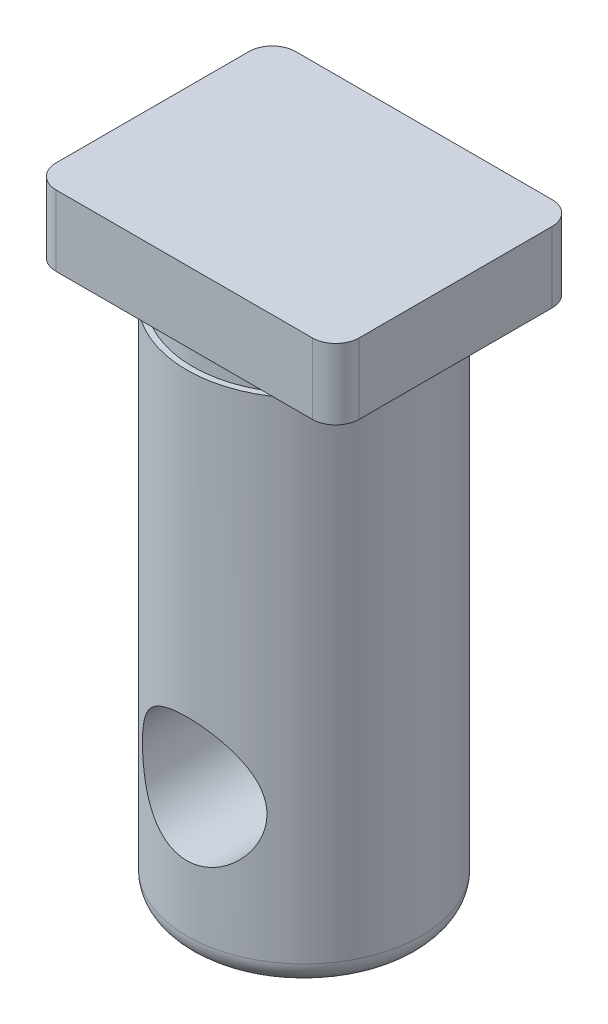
ISO-10303-21;
HEADER;
FILE_DESCRIPTION(('STEP AP214'),'2;1');
FILE_NAME('part.step','',(''),(''),'','','');
FILE_SCHEMA(('AUTOMOTIVE_DESIGN { 1 0 10303 214 1 1 1 1 }'));
ENDSEC;
DATA;
#1=APPLICATION_CONTEXT('core data for automotive mechanical design processes');
#2=APPLICATION_PROTOCOL_DEFINITION('international standard','automotive_design',2000,#1);
#3=PRODUCT_CONTEXT('',#1,'mechanical');
#4=PRODUCT('Part','Part','',(#3));
#5=PRODUCT_RELATED_PRODUCT_CATEGORY('part','',(#4));
#6=PRODUCT_DEFINITION_FORMATION('','',#4);
#7=PRODUCT_DEFINITION_CONTEXT('part definition',#1,'design');
#8=PRODUCT_DEFINITION('design','',#6,#7);
#9=PRODUCT_DEFINITION_SHAPE('','',#8);
#10=(LENGTH_UNIT() NAMED_UNIT(*) SI_UNIT(.MILLI.,.METRE.));
#11=(NAMED_UNIT(*) PLANE_ANGLE_UNIT() SI_UNIT($,.RADIAN.));
#12=(NAMED_UNIT(*) SI_UNIT($,.STERADIAN.) SOLID_ANGLE_UNIT());
#13=UNCERTAINTY_MEASURE_WITH_UNIT(LENGTH_MEASURE(1.E-05),#10,'distance_accuracy_value','');
#14=(GEOMETRIC_REPRESENTATION_CONTEXT(3) GLOBAL_UNCERTAINTY_ASSIGNED_CONTEXT((#13)) GLOBAL_UNIT_ASSIGNED_CONTEXT((#10,
#11,#12)) REPRESENTATION_CONTEXT('',''));
#15=CARTESIAN_POINT('',(0.,0.,0.));
#16=DIRECTION('',(0.,0.,1.));
#17=DIRECTION('',(1.,0.,0.));
#18=AXIS2_PLACEMENT_3D('',#15,#16,#17);
#19=CARTESIAN_POINT('',(0.,20.4216,0.));
#20=DIRECTION('',(0.,-1.,0.));
#21=DIRECTION('',(0.,0.,-1.));
#22=AXIS2_PLACEMENT_3D('',#19,#20,#21);
#23=CYLINDRICAL_SURFACE('',#22,3.94335);
#24=CARTESIAN_POINT('',(0.,0.787400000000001,0.));
#25=DIRECTION('',(0.,1.,0.));
#26=DIRECTION('',(0.,0.,1.));
#27=AXIS2_PLACEMENT_3D('',#24,#25,#26);
#28=CIRCLE('',#27,3.94335);
#29=CARTESIAN_POINT('',(0.,0.787400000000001,3.94335));
#30=VERTEX_POINT('',#29);
#31=EDGE_CURVE('E43',#30,#30,#28,.T.);
#32=ORIENTED_EDGE('',*,*,#31,.T.);
#33=EDGE_LOOP('',(#32));
#34=FACE_BOUND('',#33,.T.);
#35=CARTESIAN_POINT('',(0.,7.1755,-3.94335));
#36=CARTESIAN_POINT('',(-0.109314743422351,7.175491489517,-3.9433426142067));
#37=CARTESIAN_POINT('',(-0.218739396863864,7.16689548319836,-3.93875669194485));
#38=CARTESIAN_POINT('',(-0.434298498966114,7.13291400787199,-3.92086025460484));
#39=CARTESIAN_POINT('',(-0.540427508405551,7.1075021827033,-3.90753604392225));
#40=CARTESIAN_POINT('',(-0.745963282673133,7.04119182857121,-3.87354587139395));
#41=CARTESIAN_POINT('',(-0.845395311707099,7.00035584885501,-3.85290958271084));
#42=CARTESIAN_POINT('',(-1.03581840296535,6.90470969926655,-3.80614204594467));
#43=CARTESIAN_POINT('',(-1.12680946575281,6.84989953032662,-3.78001079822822));
#44=CARTESIAN_POINT('',(-1.30449764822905,6.7237898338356,-3.7225766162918));
#45=CARTESIAN_POINT('',(-1.39051867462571,6.65164284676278,-3.69104656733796));
#46=CARTESIAN_POINT('',(-1.54987441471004,6.49475456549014,-3.62702185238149));
#47=CARTESIAN_POINT('',(-1.62319810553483,6.41000244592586,-3.5945263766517));
#48=CARTESIAN_POINT('',(-1.76175498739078,6.22116637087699,-3.52882768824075));
#49=CARTESIAN_POINT('',(-1.82565800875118,6.11602750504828,-3.49582595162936));
#50=CARTESIAN_POINT('',(-1.93461489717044,5.89460177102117,-3.43673378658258));
#51=CARTESIAN_POINT('',(-1.97968328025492,5.77832357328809,-3.41063804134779));
#52=CARTESIAN_POINT('',(-2.04657178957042,5.54521156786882,-3.37090384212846));
#53=CARTESIAN_POINT('',(-2.06966732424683,5.42886536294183,-3.35658955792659));
#54=CARTESIAN_POINT('',(-2.09578899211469,5.19314629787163,-3.34035082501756));
#55=CARTESIAN_POINT('',(-2.09884011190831,5.0737773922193,-3.33841095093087));
#56=CARTESIAN_POINT('',(-2.08571706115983,4.85335793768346,-3.34661189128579));
#57=CARTESIAN_POINT('',(-2.07216395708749,4.75207371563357,-3.35510613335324));
#58=CARTESIAN_POINT('',(-2.03081783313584,4.55351336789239,-3.38029120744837));
#59=CARTESIAN_POINT('',(-2.00301916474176,4.45623884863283,-3.39698529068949));
#60=CARTESIAN_POINT('',(-1.93353957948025,4.26570974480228,-3.43701370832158));
#61=CARTESIAN_POINT('',(-1.89155978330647,4.17259525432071,-3.46048927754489));
#62=CARTESIAN_POINT('',(-1.79515444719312,3.9942617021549,-3.51146705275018));
#63=CARTESIAN_POINT('',(-1.74072338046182,3.90904617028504,-3.53897104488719));
#64=CARTESIAN_POINT('',(-1.61173736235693,3.73585893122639,-3.59973576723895));
#65=CARTESIAN_POINT('',(-1.53540579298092,3.64929494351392,-3.63325135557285));
#66=CARTESIAN_POINT('',(-1.36928012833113,3.48956608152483,-3.69906319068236));
#67=CARTESIAN_POINT('',(-1.27947798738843,3.41640927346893,-3.73135869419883));
#68=CARTESIAN_POINT('',(-1.08235198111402,3.28146925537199,-3.79338907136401));
#69=CARTESIAN_POINT('',(-0.97430883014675,3.22060629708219,-3.8228621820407));
#70=CARTESIAN_POINT('',(-0.747564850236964,3.11844721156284,-3.8735777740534));
#71=CARTESIAN_POINT('',(-0.628873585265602,3.07713373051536,-3.89482755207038));
#72=CARTESIAN_POINT('',(-0.395572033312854,3.01898654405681,-3.92506170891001));
#73=CARTESIAN_POINT('',(-0.281547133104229,3.00029294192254,-3.93497356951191));
#74=CARTESIAN_POINT('',(-0.0515707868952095,2.98196682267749,-3.94468818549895));
#75=CARTESIAN_POINT('',(0.0643795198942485,2.98232340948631,-3.9444967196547));
#76=CARTESIAN_POINT('',(0.283787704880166,3.00115119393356,-3.93452083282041));
#77=CARTESIAN_POINT('',(0.38743144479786,3.01799079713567,-3.92560047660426));
#78=CARTESIAN_POINT('',(0.590175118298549,3.06662377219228,-3.90027470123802));
#79=CARTESIAN_POINT('',(0.689274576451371,3.09841870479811,-3.88386850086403));
#80=CARTESIAN_POINT('',(0.883063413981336,3.17670789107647,-3.8445075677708));
#81=CARTESIAN_POINT('',(0.977578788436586,3.22355229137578,-3.82139826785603));
#82=CARTESIAN_POINT('',(1.15768289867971,3.33018391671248,-3.77074862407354));
#83=CARTESIAN_POINT('',(1.24326810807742,3.38997622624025,-3.74320654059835));
#84=CARTESIAN_POINT('',(1.41283744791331,3.52815577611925,-3.68277644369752));
#85=CARTESIAN_POINT('',(1.49566721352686,3.60784903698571,-3.6496318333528));
#86=CARTESIAN_POINT('',(1.64736854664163,3.77982211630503,-3.58371892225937));
#87=CARTESIAN_POINT('',(1.71622737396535,3.87211329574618,-3.55095099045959));
#88=CARTESIAN_POINT('',(1.84244439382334,4.07420348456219,-3.48722441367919));
#89=CARTESIAN_POINT('',(1.89874042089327,4.18475680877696,-3.45652886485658));
#90=CARTESIAN_POINT('',(1.99135240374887,4.41586544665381,-3.40402611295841));
#91=CARTESIAN_POINT('',(2.02769669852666,4.53640629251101,-3.38220631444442));
#92=CARTESIAN_POINT('',(2.07579703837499,4.7715527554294,-3.35287957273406));
#93=CARTESIAN_POINT('',(2.08961304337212,4.88558299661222,-3.3441798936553));
#94=CARTESIAN_POINT('',(2.09833946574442,5.11462084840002,-3.33871548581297));
#95=CARTESIAN_POINT('',(2.09326243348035,5.22962775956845,-3.34194283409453));
#96=CARTESIAN_POINT('',(2.06632746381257,5.44269314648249,-3.35864382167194));
#97=CARTESIAN_POINT('',(2.04655507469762,5.54113008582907,-3.37084220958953));
#98=CARTESIAN_POINT('',(1.99361124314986,5.73311276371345,-3.40242088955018));
#99=CARTESIAN_POINT('',(1.96043488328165,5.82665669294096,-3.42180381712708));
#100=CARTESIAN_POINT('',(1.87927782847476,6.01296489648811,-3.46707491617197));
#101=CARTESIAN_POINT('',(1.83047811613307,6.10528707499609,-3.493302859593));
#102=CARTESIAN_POINT('',(1.72028224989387,6.28105113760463,-3.54886567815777));
#103=CARTESIAN_POINT('',(1.65887931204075,6.36448820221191,-3.57820222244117));
#104=CARTESIAN_POINT('',(1.51494097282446,6.53258360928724,-3.6417013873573));
#105=CARTESIAN_POINT('',(1.43063833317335,6.6157044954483,-3.67595330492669));
#106=CARTESIAN_POINT('',(1.24857402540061,6.76707414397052,-3.74171870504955));
#107=CARTESIAN_POINT('',(1.15080381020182,6.83531339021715,-3.77323042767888));
#108=CARTESIAN_POINT('',(0.94121771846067,6.95620587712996,-3.83094514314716));
#109=CARTESIAN_POINT('',(0.82912958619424,7.00846272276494,-3.85700870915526));
#110=CARTESIAN_POINT('',(0.65449970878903,7.07163088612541,-3.88910871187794));
#111=CARTESIAN_POINT('',(0.595245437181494,7.09014400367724,-3.89863908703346));
#112=CARTESIAN_POINT('',(0.475001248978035,7.12189906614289,-3.91510578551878));
#113=CARTESIAN_POINT('',(0.414012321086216,7.13514395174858,-3.92204355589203));
#114=CARTESIAN_POINT('',(0.294399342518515,7.15555173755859,-3.932776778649));
#115=CARTESIAN_POINT('',(0.235841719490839,7.16302130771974,-3.93673036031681));
#116=CARTESIAN_POINT('',(0.118200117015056,7.17299777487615,-3.94201898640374));
#117=CARTESIAN_POINT('',(0.0591161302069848,7.17550460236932,-3.94335399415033));
#118=CARTESIAN_POINT('',(0.,7.1755,-3.94335));
#119=B_SPLINE_CURVE_WITH_KNOTS('',3,(#35,#36,#37,#38,#39,#40,#41,#42,#43,#44,#45,#46,#47,#48,
#49,#50,#51,#52,#53,#54,#55,#56,#57,#58,#59,#60,#61,#62,#63,#64,#65,#66,#67,#68,#69,#70,#71,#72,
#73,#74,#75,#76,#77,#78,#79,#80,#81,#82,#83,#84,#85,#86,#87,#88,#89,#90,#91,#92,#93,#94,#95,#96,
#97,#98,#99,#100,#101,#102,#103,#104,#105,#106,#107,#108,#109,#110,#111,#112,#113,#114,#115,
#116,#117,#118),.UNSPECIFIED.,.T.,.F.,(4,2,2,2,2,2,2,2,2,2,2,2,2,2,2,2,2,2,2,2,2,2,2,2,2,2,2,2,
2,2,2,2,2,2,2,2,2,2,2,2,2,4),(0.,0.327714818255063,0.655944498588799,0.982857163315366,
1.30976980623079,1.65818512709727,2.00690141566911,2.38713472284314,2.76707443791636,
3.12330154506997,3.47908450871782,3.78526452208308,4.09156603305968,4.40477392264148,
4.71812110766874,5.07712719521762,5.43634856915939,5.81666605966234,6.19664531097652,
6.5426189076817,6.88839462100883,7.20308112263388,7.5178004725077,7.84044870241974,
8.16322386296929,8.52058753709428,8.87827564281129,9.25962628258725,9.64043384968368,
9.9839361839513,10.3272103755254,10.6293158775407,10.9315323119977,11.2533037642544,
11.5752488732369,11.9433158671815,12.3116175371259,12.6884258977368,12.8765975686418,
13.0646640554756,13.241885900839,13.4191102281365),.UNSPECIFIED.);
#120=CARTESIAN_POINT('',(0.,7.1755,-3.94335));
#121=VERTEX_POINT('',#120);
#122=EDGE_CURVE('E138',#121,#121,#119,.T.);
#123=ORIENTED_EDGE('',*,*,#122,.T.);
#124=EDGE_LOOP('',(#123));
#125=FACE_BOUND('',#124,.T.);
#126=CARTESIAN_POINT('',(2.0955,5.08,3.3404923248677));
#127=CARTESIAN_POINT('',(2.09549043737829,4.9719163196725,3.34050469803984));
#128=CARTESIAN_POINT('',(2.08707965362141,4.86371669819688,3.34582046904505));
#129=CARTESIAN_POINT('',(2.05390371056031,4.65073086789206,3.3662800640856));
#130=CARTESIAN_POINT('',(2.02910853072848,4.54595129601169,3.38144192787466));
#131=CARTESIAN_POINT('',(1.96459585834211,4.3432983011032,3.419319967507));
#132=CARTESIAN_POINT('',(1.9249659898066,4.24538825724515,3.44199169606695));
#133=CARTESIAN_POINT('',(1.83217755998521,4.05763749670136,3.49226451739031));
#134=CARTESIAN_POINT('',(1.77901688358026,3.96779804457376,3.51986638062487));
#135=CARTESIAN_POINT('',(1.65483572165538,3.7894468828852,3.58004417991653));
#136=CARTESIAN_POINT('',(1.58260716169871,3.70185144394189,3.61284381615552));
#137=CARTESIAN_POINT('',(1.42484208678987,3.53929089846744,3.67792335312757));
#138=CARTESIAN_POINT('',(1.33929819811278,3.46433283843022,3.71020295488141));
#139=CARTESIAN_POINT('',(1.14913220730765,3.32338701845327,3.77363336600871));
#140=CARTESIAN_POINT('',(1.04353906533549,3.25856733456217,3.80449605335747));
#141=CARTESIAN_POINT('',(0.820997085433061,3.14803607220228,3.85863267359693));
#142=CARTESIAN_POINT('',(0.704056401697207,3.10231089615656,3.88191200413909));
#143=CARTESIAN_POINT('',(0.471880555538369,3.03503434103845,3.91663280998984));
#144=CARTESIAN_POINT('',(0.357234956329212,3.01186420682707,3.92886149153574));
#145=CARTESIAN_POINT('',(0.125086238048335,2.98498226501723,3.94307621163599));
#146=CARTESIAN_POINT('',(0.00758517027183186,2.98125688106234,3.94506939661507));
#147=CARTESIAN_POINT('',(-0.214590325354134,2.9928433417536,3.93892135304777));
#148=CARTESIAN_POINT('',(-0.319394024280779,3.00632664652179,3.93175344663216));
#149=CARTESIAN_POINT('',(-0.52499016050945,3.04861594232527,3.90961456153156));
#150=CARTESIAN_POINT('',(-0.625782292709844,3.07742309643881,3.89464299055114));
#151=CARTESIAN_POINT('',(-0.822089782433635,3.14962009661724,3.85801494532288));
#152=CARTESIAN_POINT('',(-0.917526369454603,3.19318247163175,3.8362796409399));
#153=CARTESIAN_POINT('',(-1.09994041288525,3.29335747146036,3.78801473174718));
#154=CARTESIAN_POINT('',(-1.18691500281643,3.34997449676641,3.76148351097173));
#155=CARTESIAN_POINT('',(-1.35951499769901,3.48131878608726,3.70281889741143));
#156=CARTESIAN_POINT('',(-1.44407760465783,3.5573111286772,3.67038994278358));
#157=CARTESIAN_POINT('',(-1.59986828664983,3.72191216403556,3.60521521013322));
#158=CARTESIAN_POINT('',(-1.67108382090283,3.81053258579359,3.57246916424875));
#159=CARTESIAN_POINT('',(-1.80368767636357,4.00628103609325,3.5075047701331));
#160=CARTESIAN_POINT('',(-1.86387016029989,4.11431483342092,3.4755284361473));
#161=CARTESIAN_POINT('',(-1.96477690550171,4.34100257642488,3.41950589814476));
#162=CARTESIAN_POINT('',(-2.0055231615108,4.45964433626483,3.3954507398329));
#163=CARTESIAN_POINT('',(-2.06291613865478,4.69418046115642,3.36086803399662));
#164=CARTESIAN_POINT('',(-2.08124952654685,4.809517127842,3.34940150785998));
#165=CARTESIAN_POINT('',(-2.09839324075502,5.04215286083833,3.33869412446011));
#166=CARTESIAN_POINT('',(-2.09722214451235,5.15944995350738,3.3394416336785));
#167=CARTESIAN_POINT('',(-2.07693699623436,5.37618387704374,3.35207876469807));
#168=CARTESIAN_POINT('',(-2.06019701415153,5.47594503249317,3.36249380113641));
#169=CARTESIAN_POINT('',(-2.0129372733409,5.6709987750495,3.39099522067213));
#170=CARTESIAN_POINT('',(-1.98241217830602,5.7662896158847,3.40908457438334));
#171=CARTESIAN_POINT('',(-1.907082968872,5.95458473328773,3.45180945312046));
#172=CARTESIAN_POINT('',(-1.86170412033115,6.04729877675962,3.47670036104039));
#173=CARTESIAN_POINT('',(-1.75843781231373,6.22434830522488,3.53005418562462));
#174=CARTESIAN_POINT('',(-1.70054397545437,6.30867948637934,3.55851892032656));
#175=CARTESIAN_POINT('',(-1.56405134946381,6.47946022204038,3.62079549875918));
#176=CARTESIAN_POINT('',(-1.48366406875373,6.56442362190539,3.65478155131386));
#177=CARTESIAN_POINT('',(-1.30939857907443,6.72020148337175,3.72077523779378));
#178=CARTESIAN_POINT('',(-1.21551384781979,6.79100906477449,3.75278190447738));
#179=CARTESIAN_POINT('',(-1.01192831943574,6.91906193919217,3.81283470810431));
#180=CARTESIAN_POINT('',(-0.901740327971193,6.97564031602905,3.84066743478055));
#181=CARTESIAN_POINT('',(-0.671508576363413,7.06886337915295,3.8875228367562));
#182=CARTESIAN_POINT('',(-0.551474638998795,7.10552766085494,3.90655416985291));
#183=CARTESIAN_POINT('',(-0.317704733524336,7.15436986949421,3.93211342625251));
#184=CARTESIAN_POINT('',(-0.204512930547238,7.168603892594,3.93968824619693));
#185=CARTESIAN_POINT('',(0.0228884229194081,7.17845874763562,3.94492014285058));
#186=CARTESIAN_POINT('',(0.13709748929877,7.17408800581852,3.94258170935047));
#187=CARTESIAN_POINT('',(0.353583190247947,7.14809812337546,3.92884425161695));
#188=CARTESIAN_POINT('',(0.456082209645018,7.12789041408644,3.91818692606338));
#189=CARTESIAN_POINT('',(0.656015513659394,7.07286689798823,3.88971135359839));
#190=CARTESIAN_POINT('',(0.753449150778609,7.03804922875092,3.87189219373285));
#191=CARTESIAN_POINT('',(0.944710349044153,6.95349758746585,3.82981574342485));
#192=CARTESIAN_POINT('',(1.03825935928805,6.90324615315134,3.80533915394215));
#193=CARTESIAN_POINT('',(1.21594042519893,6.78989187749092,3.75234701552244));
#194=CARTESIAN_POINT('',(1.30006837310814,6.72678346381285,3.72382971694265));
#195=CARTESIAN_POINT('',(1.46629816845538,6.58152211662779,3.66178721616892));
#196=CARTESIAN_POINT('',(1.54716415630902,6.49803914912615,3.62805589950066));
#197=CARTESIAN_POINT('',(1.69429362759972,6.31854371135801,3.56172770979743));
#198=CARTESIAN_POINT('',(1.76054117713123,6.22251774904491,3.5291321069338));
#199=CARTESIAN_POINT('',(1.87979240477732,6.01413461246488,3.46715419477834));
#200=CARTESIAN_POINT('',(1.93191732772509,5.90118445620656,3.43803070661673));
#201=CARTESIAN_POINT('',(1.99471803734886,5.72506586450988,3.40171840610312));
#202=CARTESIAN_POINT('',(2.01307791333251,5.66529868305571,3.39084935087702));
#203=CARTESIAN_POINT('',(2.0444544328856,5.54394498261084,3.37202490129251));
#204=CARTESIAN_POINT('',(2.05747462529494,5.48235970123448,3.36406757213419));
#205=CARTESIAN_POINT('',(2.07692188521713,5.36414305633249,3.35209231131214));
#206=CARTESIAN_POINT('',(2.08387691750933,5.30763004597,3.34776068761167));
#207=CARTESIAN_POINT('',(2.09316859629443,5.19408880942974,3.3419573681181));
#208=CARTESIAN_POINT('',(2.09550504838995,5.13706056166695,3.34048579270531));
#209=CARTESIAN_POINT('',(2.0955,5.08,3.3404923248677));
#210=B_SPLINE_CURVE_WITH_KNOTS('',3,(#126,#127,#128,#129,#130,#131,#132,#133,#134,#135,#136,
#137,#138,#139,#140,#141,#142,#143,#144,#145,#146,#147,#148,#149,#150,#151,#152,#153,#154,#155,
#156,#157,#158,#159,#160,#161,#162,#163,#164,#165,#166,#167,#168,#169,#170,#171,#172,#173,#174,
#175,#176,#177,#178,#179,#180,#181,#182,#183,#184,#185,#186,#187,#188,#189,#190,#191,#192,#193,
#194,#195,#196,#197,#198,#199,#200,#201,#202,#203,#204,#205,#206,#207,#208,#209),.UNSPECIFIED.,
.T.,.F.,(4,2,2,2,2,2,2,2,2,2,2,2,2,2,2,2,2,2,2,2,2,2,2,2,2,2,2,2,2,2,2,2,2,2,2,2,2,2,2,2,2,4),
(0.,0.324018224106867,0.648631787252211,0.971357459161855,1.29413361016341,1.64720890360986,
2.00048042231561,2.38151776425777,2.76228329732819,3.11309413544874,3.46366000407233,
3.77989588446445,4.09615577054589,4.41624914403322,4.73645057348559,5.08965133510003,
5.4431823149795,5.82439058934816,6.20516644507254,6.55505721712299,6.90461474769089,
7.20831424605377,7.51213140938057,7.82946226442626,8.14695520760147,8.51077154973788,
8.87476429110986,9.25352704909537,9.6319164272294,9.97303628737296,10.3140016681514,
10.6276216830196,10.9412816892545,11.2668842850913,11.5926283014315,11.9541254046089,
12.3160146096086,12.6969183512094,12.887041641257,13.077038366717,13.2480899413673,
13.4191487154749),.UNSPECIFIED.);
#211=CARTESIAN_POINT('',(2.0955,5.08,3.3404923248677));
#212=VERTEX_POINT('',#211);
#213=EDGE_CURVE('E176',#212,#212,#210,.T.);
#214=ORIENTED_EDGE('',*,*,#213,.T.);
#215=EDGE_LOOP('',(#214));
#216=FACE_BOUND('',#215,.T.);
#217=CARTESIAN_POINT('',(0.,17.2847,0.));
#218=DIRECTION('',(0.,1.,0.));
#219=DIRECTION('',(0.,0.,1.));
#220=AXIS2_PLACEMENT_3D('',#217,#218,#219);
#221=CIRCLE('',#220,3.94335);
#222=CARTESIAN_POINT('',(0.,17.2847,3.94335));
#223=VERTEX_POINT('',#222);
#224=EDGE_CURVE('E170',#223,#223,#221,.T.);
#225=ORIENTED_EDGE('',*,*,#224,.F.);
#226=EDGE_LOOP('',(#225));
#227=FACE_BOUND('',#226,.T.);
#228=ADVANCED_FACE('F34',(#34,#125,#216,#227),#23,.T.);
#229=CARTESIAN_POINT('',(0.,0.,0.));
#230=DIRECTION('',(0.,1.,0.));
#231=DIRECTION('',(0.,0.,1.));
#232=AXIS2_PLACEMENT_3D('',#229,#230,#231);
#233=PLANE('',#232);
#234=CARTESIAN_POINT('',(0.,0.,0.));
#235=DIRECTION('',(0.,1.,0.));
#236=DIRECTION('',(0.,0.,1.));
#237=AXIS2_PLACEMENT_3D('',#234,#235,#236);
#238=CIRCLE('',#237,3.15595);
#239=CARTESIAN_POINT('',(0.,0.,3.15595));
#240=VERTEX_POINT('',#239);
#241=EDGE_CURVE('E11',#240,#240,#238,.F.);
#242=ORIENTED_EDGE('',*,*,#241,.T.);
#243=EDGE_LOOP('',(#242));
#244=FACE_BOUND('',#243,.T.);
#245=ADVANCED_FACE('F230',(#244),#233,.F.);
#246=CARTESIAN_POINT('',(0.,17.2847,0.));
#247=DIRECTION('',(0.,1.,0.));
#248=DIRECTION('',(0.,0.,1.));
#249=AXIS2_PLACEMENT_3D('',#246,#247,#248);
#250=PLANE('',#249);
#251=CARTESIAN_POINT('',(0.,17.2847,0.));
#252=DIRECTION('',(0.,1.,0.));
#253=DIRECTION('',(0.,0.,1.));
#254=AXIS2_PLACEMENT_3D('',#251,#252,#253);
#255=CIRCLE('',#254,3.7465);
#256=CARTESIAN_POINT('',(0.,17.2847,3.7465));
#257=VERTEX_POINT('',#256);
#258=EDGE_CURVE('E158',#257,#257,#255,.T.);
#259=ORIENTED_EDGE('',*,*,#258,.F.);
#260=EDGE_LOOP('',(#259));
#261=FACE_BOUND('',#260,.T.);
#262=ORIENTED_EDGE('',*,*,#224,.T.);
#263=EDGE_LOOP('',(#262));
#264=FACE_BOUND('',#263,.T.);
#265=ADVANCED_FACE('F226',(#261,#264),#250,.T.);
#266=CARTESIAN_POINT('',(0.,17.2847,0.));
#267=DIRECTION('',(0.,1.,0.));
#268=DIRECTION('',(0.,0.,1.));
#269=AXIS2_PLACEMENT_3D('',#266,#267,#268);
#270=CYLINDRICAL_SURFACE('',#269,3.7465);
#271=CARTESIAN_POINT('',(0.,18.0467,0.));
#272=DIRECTION('',(0.,-1.,0.));
#273=DIRECTION('',(0.,0.,-1.));
#274=AXIS2_PLACEMENT_3D('',#271,#272,#273);
#275=CIRCLE('',#274,3.7465);
#276=CARTESIAN_POINT('',(0.,18.0467,3.7465));
#277=VERTEX_POINT('',#276);
#278=EDGE_CURVE('E173',#277,#277,#275,.F.);
#279=CARTESIAN_POINT('',(0.,18.0467,3.7465));
#280=CARTESIAN_POINT('',(0.,18.0387625,3.7465));
#281=CARTESIAN_POINT('',(0.,18.030825,3.7465));
#282=CARTESIAN_POINT('',(0.,18.01495,3.7465));
#283=CARTESIAN_POINT('',(0.,18.0070125,3.7465));
#284=CARTESIAN_POINT('',(0.,17.9911375,3.7465));
#285=CARTESIAN_POINT('',(0.,17.9832,3.7465));
#286=CARTESIAN_POINT('',(0.,17.967325,3.7465));
#287=CARTESIAN_POINT('',(0.,17.9593875,3.7465));
#288=CARTESIAN_POINT('',(0.,17.9435125,3.7465));
#289=CARTESIAN_POINT('',(0.,17.935575,3.7465));
#290=CARTESIAN_POINT('',(0.,17.9197,3.7465));
#291=CARTESIAN_POINT('',(0.,17.9117625,3.7465));
#292=CARTESIAN_POINT('',(0.,17.8958875,3.7465));
#293=CARTESIAN_POINT('',(0.,17.88795,3.7465));
#294=CARTESIAN_POINT('',(0.,17.872075,3.7465));
#295=CARTESIAN_POINT('',(0.,17.8641375,3.7465));
#296=CARTESIAN_POINT('',(0.,17.8482625,3.7465));
#297=CARTESIAN_POINT('',(0.,17.840325,3.7465));
#298=CARTESIAN_POINT('',(0.,17.82445,3.7465));
#299=CARTESIAN_POINT('',(0.,17.8165125,3.7465));
#300=CARTESIAN_POINT('',(0.,17.8006375,3.7465));
#301=CARTESIAN_POINT('',(0.,17.7927,3.7465));
#302=CARTESIAN_POINT('',(0.,17.776825,3.7465));
#303=CARTESIAN_POINT('',(0.,17.7688875,3.7465));
#304=CARTESIAN_POINT('',(0.,17.7530125,3.7465));
#305=CARTESIAN_POINT('',(0.,17.745075,3.7465));
#306=CARTESIAN_POINT('',(0.,17.7292,3.7465));
#307=CARTESIAN_POINT('',(0.,17.7212625,3.7465));
#308=CARTESIAN_POINT('',(0.,17.7053875,3.7465));
#309=CARTESIAN_POINT('',(0.,17.69745,3.7465));
#310=CARTESIAN_POINT('',(0.,17.681575,3.7465));
#311=CARTESIAN_POINT('',(0.,17.6736375,3.7465));
#312=CARTESIAN_POINT('',(0.,17.6577625,3.7465));
#313=CARTESIAN_POINT('',(0.,17.649825,3.7465));
#314=CARTESIAN_POINT('',(0.,17.63395,3.7465));
#315=CARTESIAN_POINT('',(0.,17.6260125,3.7465));
#316=CARTESIAN_POINT('',(0.,17.6101375,3.7465));
#317=CARTESIAN_POINT('',(0.,17.6022,3.7465));
#318=CARTESIAN_POINT('',(0.,17.586325,3.7465));
#319=CARTESIAN_POINT('',(0.,17.5783875,3.7465));
#320=CARTESIAN_POINT('',(0.,17.5625125,3.7465));
#321=CARTESIAN_POINT('',(0.,17.554575,3.7465));
#322=CARTESIAN_POINT('',(0.,17.5387,3.7465));
#323=CARTESIAN_POINT('',(0.,17.5307625,3.7465));
#324=CARTESIAN_POINT('',(0.,17.5148875,3.7465));
#325=CARTESIAN_POINT('',(0.,17.50695,3.7465));
#326=CARTESIAN_POINT('',(0.,17.491075,3.7465));
#327=CARTESIAN_POINT('',(0.,17.4831375,3.7465));
#328=CARTESIAN_POINT('',(0.,17.4672625,3.7465));
#329=CARTESIAN_POINT('',(0.,17.459325,3.7465));
#330=CARTESIAN_POINT('',(0.,17.44345,3.7465));
#331=CARTESIAN_POINT('',(0.,17.4355125,3.7465));
#332=CARTESIAN_POINT('',(0.,17.4196375,3.7465));
#333=CARTESIAN_POINT('',(0.,17.4117,3.7465));
#334=CARTESIAN_POINT('',(0.,17.395825,3.7465));
#335=CARTESIAN_POINT('',(0.,17.3878875,3.7465));
#336=CARTESIAN_POINT('',(0.,17.3720125,3.7465));
#337=CARTESIAN_POINT('',(0.,17.364075,3.7465));
#338=CARTESIAN_POINT('',(0.,17.3482,3.7465));
#339=CARTESIAN_POINT('',(0.,17.3402625,3.7465));
#340=CARTESIAN_POINT('',(0.,17.3243875,3.7465));
#341=CARTESIAN_POINT('',(0.,17.31645,3.7465));
#342=CARTESIAN_POINT('',(0.,17.300575,3.7465));
#343=CARTESIAN_POINT('',(0.,17.2926375,3.7465));
#344=CARTESIAN_POINT('',(0.,17.2847,3.7465));
#345=B_SPLINE_CURVE_WITH_KNOTS('',3,(#279,#280,#281,#282,#283,#284,#285,#286,#287,#288,#289,
#290,#291,#292,#293,#294,#295,#296,#297,#298,#299,#300,#301,#302,#303,#304,#305,#306,#307,#308,
#309,#310,#311,#312,#313,#314,#315,#316,#317,#318,#319,#320,#321,#322,#323,#324,#325,#326,#327,
#328,#329,#330,#331,#332,#333,#334,#335,#336,#337,#338,#339,#340,#341,#342,#343,#344),
.UNSPECIFIED.,.F.,.F.,(4,2,2,2,2,2,2,2,2,2,2,2,2,2,2,2,2,2,2,2,2,2,2,2,2,2,2,2,2,2,2,2,4),(0.,
0.0238124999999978,0.0476249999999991,0.0714375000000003,0.0952499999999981,0.119062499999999,
0.142875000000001,0.166687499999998,0.1905,0.214312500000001,0.238124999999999,0.2619375,
0.285750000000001,0.309562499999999,0.333375,0.357187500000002,0.381000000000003,
0.404812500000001,0.428625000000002,0.452437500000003,0.476250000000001,0.500062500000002,
0.523875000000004,0.547687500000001,0.571500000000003,0.595312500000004,0.619125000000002,
0.642937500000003,0.666750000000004,0.690562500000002,0.714375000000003,0.738187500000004,
0.762000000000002),.UNSPECIFIED.);
#346=EDGE_CURVE('BSEAM223',#277,#257,#345,.T.);
#347=ORIENTED_EDGE('',*,*,#278,.F.);
#348=ORIENTED_EDGE('',*,*,#258,.T.);
#349=ORIENTED_EDGE('',*,*,#346,.T.);
#350=ORIENTED_EDGE('',*,*,#346,.F.);
#351=EDGE_LOOP('',(#347,#349,#348,#350));
#352=FACE_BOUND('',#351,.T.);
#353=ADVANCED_FACE('F223',(#352),#270,.T.);
#354=CARTESIAN_POINT('',(4.312666,18.0467,-3.24485));
#355=DIRECTION('',(0.,1.,0.));
#356=DIRECTION('',(0.,0.,1.));
#357=AXIS2_PLACEMENT_3D('',#354,#355,#356);
#358=CYLINDRICAL_SURFACE('',#357,0.7874);
#359=CARTESIAN_POINT('',(4.312666,20.4216,-3.24485));
#360=DIRECTION('',(0.,1.,0.));
#361=DIRECTION('',(0.,0.,-1.));
#362=AXIS2_PLACEMENT_3D('',#359,#360,#361);
#363=CIRCLE('',#362,0.7874);
#364=CARTESIAN_POINT('',(5.100066,20.4216,-3.24484999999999));
#365=VERTEX_POINT('',#364);
#366=CARTESIAN_POINT('',(4.31266599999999,20.4216,-4.03225));
#367=VERTEX_POINT('',#366);
#368=EDGE_CURVE('E134',#365,#367,#363,.T.);
#369=ORIENTED_EDGE('',*,*,#368,.F.);
#370=DIRECTION('',(0.,1.,0.));
#371=VECTOR('',#370,1.);
#372=CARTESIAN_POINT('',(5.100066,18.0467,-3.24484999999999));
#373=LINE('',#372,#371);
#374=CARTESIAN_POINT('',(5.100066,18.0467,-3.24484999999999));
#375=VERTEX_POINT('',#374);
#376=EDGE_CURVE('E51',#375,#365,#373,.T.);
#377=ORIENTED_EDGE('',*,*,#376,.F.);
#378=CARTESIAN_POINT('',(4.312666,18.0467,-3.24485));
#379=DIRECTION('',(0.,1.,0.));
#380=DIRECTION('',(0.,0.,-1.));
#381=AXIS2_PLACEMENT_3D('',#378,#379,#380);
#382=CIRCLE('',#381,0.7874);
#383=CARTESIAN_POINT('',(4.31266599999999,18.0467,-4.03225));
#384=VERTEX_POINT('',#383);
#385=EDGE_CURVE('E156',#375,#384,#382,.T.);
#386=ORIENTED_EDGE('',*,*,#385,.T.);
#387=DIRECTION('',(0.,1.,0.));
#388=VECTOR('',#387,1.);
#389=CARTESIAN_POINT('',(4.31266599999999,18.0467,-4.03225));
#390=LINE('',#389,#388);
#391=EDGE_CURVE('E92',#384,#367,#390,.T.);
#392=ORIENTED_EDGE('',*,*,#391,.T.);
#393=EDGE_LOOP('',(#369,#377,#386,#392));
#394=FACE_BOUND('',#393,.T.);
#395=ADVANCED_FACE('F202',(#394),#358,.T.);
#396=CARTESIAN_POINT('',(5.100066,18.0467,-3.24484999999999));
#397=DIRECTION('',(1.,0.,0.));
#398=DIRECTION('',(0.,0.,-1.));
#399=AXIS2_PLACEMENT_3D('',#396,#397,#398);
#400=PLANE('',#399);
#401=DIRECTION('',(0.,0.,-1.));
#402=VECTOR('',#401,1.);
#403=CARTESIAN_POINT('',(5.100066,20.4216,-3.24484999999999));
#404=LINE('',#403,#402);
#405=CARTESIAN_POINT('',(5.100066,20.4216,3.24484999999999));
#406=VERTEX_POINT('',#405);
#407=EDGE_CURVE('E153',#406,#365,#404,.T.);
#408=ORIENTED_EDGE('',*,*,#407,.F.);
#409=DIRECTION('',(0.,1.,0.));
#410=VECTOR('',#409,1.);
#411=CARTESIAN_POINT('',(5.100066,18.0467,3.24484999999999));
#412=LINE('',#411,#410);
#413=CARTESIAN_POINT('',(5.100066,18.0467,3.24484999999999));
#414=VERTEX_POINT('',#413);
#415=EDGE_CURVE('E80',#414,#406,#412,.T.);
#416=ORIENTED_EDGE('',*,*,#415,.F.);
#417=DIRECTION('',(0.,0.,-1.));
#418=VECTOR('',#417,1.);
#419=CARTESIAN_POINT('',(5.100066,18.0467,-3.24484999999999));
#420=LINE('',#419,#418);
#421=EDGE_CURVE('E124',#414,#375,#420,.T.);
#422=ORIENTED_EDGE('',*,*,#421,.T.);
#423=ORIENTED_EDGE('',*,*,#376,.T.);
#424=EDGE_LOOP('',(#408,#416,#422,#423));
#425=FACE_BOUND('',#424,.T.);
#426=ADVANCED_FACE('F199',(#425),#400,.T.);
#427=CARTESIAN_POINT('',(4.312666,18.0467,3.24485));
#428=DIRECTION('',(0.,1.,0.));
#429=DIRECTION('',(0.,0.,1.));
#430=AXIS2_PLACEMENT_3D('',#427,#428,#429);
#431=CYLINDRICAL_SURFACE('',#430,0.7874);
#432=CARTESIAN_POINT('',(4.312666,20.4216,3.24485));
#433=DIRECTION('',(0.,1.,0.));
#434=DIRECTION('',(0.,0.,1.));
#435=AXIS2_PLACEMENT_3D('',#432,#433,#434);
#436=CIRCLE('',#435,0.7874);
#437=CARTESIAN_POINT('',(4.312666,20.4216,4.03225));
#438=VERTEX_POINT('',#437);
#439=EDGE_CURVE('E111',#438,#406,#436,.T.);
#440=ORIENTED_EDGE('',*,*,#439,.F.);
#441=DIRECTION('',(0.,1.,0.));
#442=VECTOR('',#441,1.);
#443=CARTESIAN_POINT('',(4.312666,18.0467,4.03225));
#444=LINE('',#443,#442);
#445=CARTESIAN_POINT('',(4.312666,18.0467,4.03225));
#446=VERTEX_POINT('',#445);
#447=EDGE_CURVE('E106',#446,#438,#444,.T.);
#448=ORIENTED_EDGE('',*,*,#447,.F.);
#449=CARTESIAN_POINT('',(4.312666,18.0467,3.24485));
#450=DIRECTION('',(0.,1.,0.));
#451=DIRECTION('',(0.,0.,1.));
#452=AXIS2_PLACEMENT_3D('',#449,#450,#451);
#453=CIRCLE('',#452,0.7874);
#454=EDGE_CURVE('E109',#446,#414,#453,.T.);
#455=ORIENTED_EDGE('',*,*,#454,.T.);
#456=ORIENTED_EDGE('',*,*,#415,.T.);
#457=EDGE_LOOP('',(#440,#448,#455,#456));
#458=FACE_BOUND('',#457,.T.);
#459=ADVANCED_FACE('F108',(#458),#431,.T.);
#460=CARTESIAN_POINT('',(-4.31266599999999,18.0467,4.03225));
#461=DIRECTION('',(0.,0.,1.));
#462=DIRECTION('',(1.,0.,0.));
#463=AXIS2_PLACEMENT_3D('',#460,#461,#462);
#464=PLANE('',#463);
#465=DIRECTION('',(1.,0.,0.));
#466=VECTOR('',#465,1.);
#467=CARTESIAN_POINT('',(-4.31266599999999,20.4216,4.03225));
#468=LINE('',#467,#466);
#469=CARTESIAN_POINT('',(-4.312666,20.4216,4.03225));
#470=VERTEX_POINT('',#469);
#471=EDGE_CURVE('E150',#470,#438,#468,.T.);
#472=ORIENTED_EDGE('',*,*,#471,.F.);
#473=DIRECTION('',(0.,1.,0.));
#474=VECTOR('',#473,1.);
#475=CARTESIAN_POINT('',(-4.312666,18.0467,4.03225));
#476=LINE('',#475,#474);
#477=CARTESIAN_POINT('',(-4.312666,18.0467,4.03225));
#478=VERTEX_POINT('',#477);
#479=EDGE_CURVE('E116',#478,#470,#476,.T.);
#480=ORIENTED_EDGE('',*,*,#479,.F.);
#481=DIRECTION('',(1.,0.,0.));
#482=VECTOR('',#481,1.);
#483=CARTESIAN_POINT('',(-4.31266599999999,18.0467,4.03225));
#484=LINE('',#483,#482);
#485=EDGE_CURVE('E122',#478,#446,#484,.T.);
#486=ORIENTED_EDGE('',*,*,#485,.T.);
#487=ORIENTED_EDGE('',*,*,#447,.T.);
#488=EDGE_LOOP('',(#472,#480,#486,#487));
#489=FACE_BOUND('',#488,.T.);
#490=ADVANCED_FACE('F126',(#489),#464,.T.);
#491=CARTESIAN_POINT('',(-4.312666,18.0467,3.24485));
#492=DIRECTION('',(0.,1.,0.));
#493=DIRECTION('',(0.,0.,1.));
#494=AXIS2_PLACEMENT_3D('',#491,#492,#493);
#495=CYLINDRICAL_SURFACE('',#494,0.7874);
#496=CARTESIAN_POINT('',(-4.312666,20.4216,3.24485));
#497=DIRECTION('',(0.,1.,0.));
#498=DIRECTION('',(0.,0.,1.));
#499=AXIS2_PLACEMENT_3D('',#496,#497,#498);
#500=CIRCLE('',#499,0.7874);
#501=CARTESIAN_POINT('',(-5.100066,20.4216,3.24485));
#502=VERTEX_POINT('',#501);
#503=EDGE_CURVE('E147',#502,#470,#500,.T.);
#504=ORIENTED_EDGE('',*,*,#503,.F.);
#505=DIRECTION('',(0.,1.,0.));
#506=VECTOR('',#505,1.);
#507=CARTESIAN_POINT('',(-5.100066,18.0467,3.24485));
#508=LINE('',#507,#506);
#509=CARTESIAN_POINT('',(-5.100066,18.0467,3.24485));
#510=VERTEX_POINT('',#509);
#511=EDGE_CURVE('E161',#510,#502,#508,.T.);
#512=ORIENTED_EDGE('',*,*,#511,.F.);
#513=CARTESIAN_POINT('',(-4.312666,18.0467,3.24485));
#514=DIRECTION('',(0.,1.,0.));
#515=DIRECTION('',(0.,0.,1.));
#516=AXIS2_PLACEMENT_3D('',#513,#514,#515);
#517=CIRCLE('',#516,0.7874);
#518=EDGE_CURVE('E127',#510,#478,#517,.T.);
#519=ORIENTED_EDGE('',*,*,#518,.T.);
#520=ORIENTED_EDGE('',*,*,#479,.T.);
#521=EDGE_LOOP('',(#504,#512,#519,#520));
#522=FACE_BOUND('',#521,.T.);
#523=ADVANCED_FACE('F207',(#522),#495,.T.);
#524=CARTESIAN_POINT('',(-5.100066,18.0467,-3.24484999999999));
#525=DIRECTION('',(-1.,0.,0.));
#526=DIRECTION('',(0.,0.,1.));
#527=AXIS2_PLACEMENT_3D('',#524,#525,#526);
#528=PLANE('',#527);
#529=DIRECTION('',(0.,0.,1.));
#530=VECTOR('',#529,1.);
#531=CARTESIAN_POINT('',(-5.100066,20.4216,-3.24484999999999));
#532=LINE('',#531,#530);
#533=CARTESIAN_POINT('',(-5.100066,20.4216,-3.24484999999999));
#534=VERTEX_POINT('',#533);
#535=EDGE_CURVE('E144',#534,#502,#532,.T.);
#536=ORIENTED_EDGE('',*,*,#535,.F.);
#537=DIRECTION('',(0.,1.,0.));
#538=VECTOR('',#537,1.);
#539=CARTESIAN_POINT('',(-5.100066,18.0467,-3.24484999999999));
#540=LINE('',#539,#538);
#541=CARTESIAN_POINT('',(-5.100066,18.0467,-3.24484999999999));
#542=VERTEX_POINT('',#541);
#543=EDGE_CURVE('E163',#542,#534,#540,.T.);
#544=ORIENTED_EDGE('',*,*,#543,.F.);
#545=DIRECTION('',(0.,0.,1.));
#546=VECTOR('',#545,1.);
#547=CARTESIAN_POINT('',(-5.100066,18.0467,-3.24484999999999));
#548=LINE('',#547,#546);
#549=EDGE_CURVE('E129',#542,#510,#548,.T.);
#550=ORIENTED_EDGE('',*,*,#549,.T.);
#551=ORIENTED_EDGE('',*,*,#511,.T.);
#552=EDGE_LOOP('',(#536,#544,#550,#551));
#553=FACE_BOUND('',#552,.T.);
#554=ADVANCED_FACE('F210',(#553),#528,.T.);
#555=CARTESIAN_POINT('',(-4.312666,18.0467,-3.24485));
#556=DIRECTION('',(0.,1.,0.));
#557=DIRECTION('',(0.,0.,1.));
#558=AXIS2_PLACEMENT_3D('',#555,#556,#557);
#559=CYLINDRICAL_SURFACE('',#558,0.7874);
#560=CARTESIAN_POINT('',(-4.312666,20.4216,-3.24485));
#561=DIRECTION('',(0.,1.,0.));
#562=DIRECTION('',(0.,0.,1.));
#563=AXIS2_PLACEMENT_3D('',#560,#561,#562);
#564=CIRCLE('',#563,0.7874);
#565=CARTESIAN_POINT('',(-4.31266599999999,20.4216,-4.03225));
#566=VERTEX_POINT('',#565);
#567=EDGE_CURVE('E141',#566,#534,#564,.T.);
#568=ORIENTED_EDGE('',*,*,#567,.F.);
#569=DIRECTION('',(0.,1.,0.));
#570=VECTOR('',#569,1.);
#571=CARTESIAN_POINT('',(-4.31266599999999,18.0467,-4.03225));
#572=LINE('',#571,#570);
#573=CARTESIAN_POINT('',(-4.31266599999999,18.0467,-4.03225));
#574=VERTEX_POINT('',#573);
#575=EDGE_CURVE('E165',#574,#566,#572,.T.);
#576=ORIENTED_EDGE('',*,*,#575,.F.);
#577=CARTESIAN_POINT('',(-4.312666,18.0467,-3.24485));
#578=DIRECTION('',(0.,1.,0.));
#579=DIRECTION('',(0.,0.,1.));
#580=AXIS2_PLACEMENT_3D('',#577,#578,#579);
#581=CIRCLE('',#580,0.7874);
#582=EDGE_CURVE('E360',#574,#542,#581,.T.);
#583=ORIENTED_EDGE('',*,*,#582,.T.);
#584=ORIENTED_EDGE('',*,*,#543,.T.);
#585=EDGE_LOOP('',(#568,#576,#583,#584));
#586=FACE_BOUND('',#585,.T.);
#587=ADVANCED_FACE('F214',(#586),#559,.T.);
#588=CARTESIAN_POINT('',(-4.31266599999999,18.0467,-4.03225));
#589=DIRECTION('',(0.,0.,-1.));
#590=DIRECTION('',(-1.,0.,0.));
#591=AXIS2_PLACEMENT_3D('',#588,#589,#590);
#592=PLANE('',#591);
#593=DIRECTION('',(-1.,0.,0.));
#594=VECTOR('',#593,1.);
#595=CARTESIAN_POINT('',(-4.31266599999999,20.4216,-4.03225));
#596=LINE('',#595,#594);
#597=EDGE_CURVE('E137',#367,#566,#596,.T.);
#598=ORIENTED_EDGE('',*,*,#597,.F.);
#599=ORIENTED_EDGE('',*,*,#391,.F.);
#600=DIRECTION('',(-1.,0.,0.));
#601=VECTOR('',#600,1.);
#602=CARTESIAN_POINT('',(-4.31266599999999,18.0467,-4.03225));
#603=LINE('',#602,#601);
#604=EDGE_CURVE('E353',#384,#574,#603,.T.);
#605=ORIENTED_EDGE('',*,*,#604,.T.);
#606=ORIENTED_EDGE('',*,*,#575,.T.);
#607=EDGE_LOOP('',(#598,#599,#605,#606));
#608=FACE_BOUND('',#607,.T.);
#609=ADVANCED_FACE('F197',(#608),#592,.T.);
#610=CARTESIAN_POINT('',(4.312666,18.0467,-3.24485));
#611=DIRECTION('',(0.,-1.,0.));
#612=DIRECTION('',(0.,0.,-1.));
#613=AXIS2_PLACEMENT_3D('',#610,#611,#612);
#614=PLANE('',#613);
#615=ORIENTED_EDGE('',*,*,#278,.T.);
#616=EDGE_LOOP('',(#615));
#617=FACE_BOUND('',#616,.T.);
#618=ORIENTED_EDGE('',*,*,#385,.F.);
#619=ORIENTED_EDGE('',*,*,#421,.F.);
#620=ORIENTED_EDGE('',*,*,#454,.F.);
#621=ORIENTED_EDGE('',*,*,#485,.F.);
#622=ORIENTED_EDGE('',*,*,#518,.F.);
#623=ORIENTED_EDGE('',*,*,#549,.F.);
#624=ORIENTED_EDGE('',*,*,#582,.F.);
#625=ORIENTED_EDGE('',*,*,#604,.F.);
#626=EDGE_LOOP('',(#618,#619,#620,#621,#622,#623,#624,#625));
#627=FACE_BOUND('',#626,.T.);
#628=ADVANCED_FACE('F120',(#617,#627),#614,.T.);
#629=CARTESIAN_POINT('',(0.,20.4216,0.));
#630=DIRECTION('',(0.,1.,0.));
#631=DIRECTION('',(0.,0.,1.));
#632=AXIS2_PLACEMENT_3D('',#629,#630,#631);
#633=PLANE('',#632);
#634=ORIENTED_EDGE('',*,*,#368,.T.);
#635=ORIENTED_EDGE('',*,*,#597,.T.);
#636=ORIENTED_EDGE('',*,*,#567,.T.);
#637=ORIENTED_EDGE('',*,*,#535,.T.);
#638=ORIENTED_EDGE('',*,*,#503,.T.);
#639=ORIENTED_EDGE('',*,*,#471,.T.);
#640=ORIENTED_EDGE('',*,*,#439,.T.);
#641=ORIENTED_EDGE('',*,*,#407,.T.);
#642=EDGE_LOOP('',(#634,#635,#636,#637,#638,#639,#640,#641));
#643=FACE_BOUND('',#642,.T.);
#644=ADVANCED_FACE('F192',(#643),#633,.T.);
#645=CARTESIAN_POINT('',(0.,5.08,-13.58265));
#646=DIRECTION('',(0.,0.,1.));
#647=DIRECTION('',(1.,0.,0.));
#648=AXIS2_PLACEMENT_3D('',#645,#646,#647);
#649=CYLINDRICAL_SURFACE('',#648,2.0955);
#650=ORIENTED_EDGE('',*,*,#213,.F.);
#651=EDGE_LOOP('',(#650));
#652=FACE_BOUND('',#651,.T.);
#653=ORIENTED_EDGE('',*,*,#122,.F.);
#654=EDGE_LOOP('',(#653));
#655=FACE_BOUND('',#654,.T.);
#656=ADVANCED_FACE('F188',(#652,#655),#649,.F.);
#657=CARTESIAN_POINT('',(0.,0.787400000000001,0.));
#658=DIRECTION('',(0.,1.,0.));
#659=DIRECTION('',(0.,0.,1.));
#660=AXIS2_PLACEMENT_3D('',#657,#658,#659);
#661=TOROIDAL_SURFACE('',#660,3.15595,0.7874);
#662=ORIENTED_EDGE('',*,*,#241,.F.);
#663=EDGE_LOOP('',(#662));
#664=FACE_BOUND('',#663,.T.);
#665=ORIENTED_EDGE('',*,*,#31,.F.);
#666=EDGE_LOOP('',(#665));
#667=FACE_BOUND('',#666,.T.);
#668=ADVANCED_FACE('F36',(#664,#667),#661,.T.);
#669=CLOSED_SHELL('',(#228,#245,#265,#353,#395,#426,#459,#490,#523,#554,#587,#609,#628,#644,
#656,#668));
#670=MANIFOLD_SOLID_BREP('B2',#669);
#671=ADVANCED_BREP_SHAPE_REPRESENTATION('',(#18,#670),#14);
#672=SHAPE_DEFINITION_REPRESENTATION(#9,#671);
ENDSEC;
END-ISO-10303-21;
